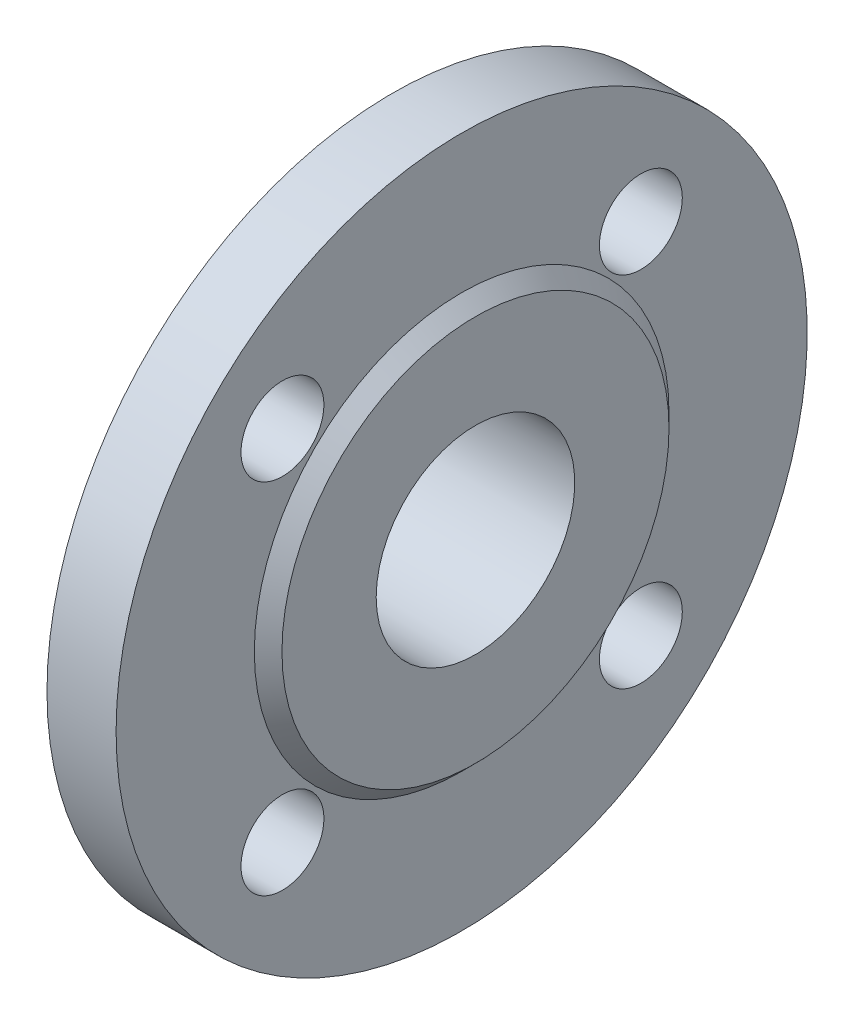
ISO-10303-21;
HEADER;
FILE_DESCRIPTION(('STEP AP214'),'2;1');
FILE_NAME('part.step','',(''),(''),'','','');
FILE_SCHEMA(('AUTOMOTIVE_DESIGN { 1 0 10303 214 1 1 1 1 }'));
ENDSEC;
DATA;
#1=APPLICATION_CONTEXT('core data for automotive mechanical design processes');
#2=APPLICATION_PROTOCOL_DEFINITION('international standard','automotive_design',2000,#1);
#3=PRODUCT_CONTEXT('',#1,'mechanical');
#4=PRODUCT('Part','Part','',(#3));
#5=PRODUCT_RELATED_PRODUCT_CATEGORY('part','',(#4));
#6=PRODUCT_DEFINITION_FORMATION('','',#4);
#7=PRODUCT_DEFINITION_CONTEXT('part definition',#1,'design');
#8=PRODUCT_DEFINITION('design','',#6,#7);
#9=PRODUCT_DEFINITION_SHAPE('','',#8);
#10=(LENGTH_UNIT() NAMED_UNIT(*) SI_UNIT(.MILLI.,.METRE.));
#11=(NAMED_UNIT(*) PLANE_ANGLE_UNIT() SI_UNIT($,.RADIAN.));
#12=(NAMED_UNIT(*) SI_UNIT($,.STERADIAN.) SOLID_ANGLE_UNIT());
#13=UNCERTAINTY_MEASURE_WITH_UNIT(LENGTH_MEASURE(1.E-05),#10,'distance_accuracy_value','');
#14=(GEOMETRIC_REPRESENTATION_CONTEXT(3) GLOBAL_UNCERTAINTY_ASSIGNED_CONTEXT((#13)) GLOBAL_UNIT_ASSIGNED_CONTEXT((#10,
#11,#12)) REPRESENTATION_CONTEXT('',''));
#15=CARTESIAN_POINT('',(0.,0.,0.));
#16=DIRECTION('',(0.,0.,1.));
#17=DIRECTION('',(1.,0.,0.));
#18=AXIS2_PLACEMENT_3D('',#15,#16,#17);
#19=CARTESIAN_POINT('',(678.,-385.45,0.));
#20=DIRECTION('',(1.,0.,0.));
#21=DIRECTION('',(0.,0.,-1.));
#22=AXIS2_PLACEMENT_3D('',#19,#20,#21);
#23=PLANE('',#22);
#24=CARTESIAN_POINT('',(678.,-407.,0.));
#25=DIRECTION('',(-1.,0.,0.));
#26=DIRECTION('',(0.,0.,1.));
#27=AXIS2_PLACEMENT_3D('',#24,#25,#26);
#28=CIRCLE('',#27,21.55);
#29=CARTESIAN_POINT('',(678.,-407.,21.55));
#30=VERTEX_POINT('',#29);
#31=EDGE_CURVE('E60',#30,#30,#28,.T.);
#32=ORIENTED_EDGE('',*,*,#31,.F.);
#33=EDGE_LOOP('',(#32));
#34=FACE_BOUND('',#33,.T.);
#35=CARTESIAN_POINT('',(678.,-407.,0.));
#36=DIRECTION('',(-1.,0.,0.));
#37=DIRECTION('',(0.,0.,1.));
#38=AXIS2_PLACEMENT_3D('',#35,#36,#37);
#39=CIRCLE('',#38,24.15);
#40=CARTESIAN_POINT('',(678.,-407.,24.15));
#41=VERTEX_POINT('',#40);
#42=EDGE_CURVE('E10',#41,#41,#39,.T.);
#43=ORIENTED_EDGE('',*,*,#42,.T.);
#44=EDGE_LOOP('',(#43));
#45=FACE_BOUND('',#44,.T.);
#46=ADVANCED_FACE('F29',(#34,#45),#23,.F.);
#47=CARTESIAN_POINT('',(678.,-407.,0.));
#48=DIRECTION('',(-1.,0.,0.));
#49=DIRECTION('',(0.,0.,1.));
#50=AXIS2_PLACEMENT_3D('',#47,#48,#49);
#51=CYLINDRICAL_SURFACE('',#50,24.15);
#52=ORIENTED_EDGE('',*,*,#42,.F.);
#53=EDGE_LOOP('',(#52));
#54=FACE_BOUND('',#53,.T.);
#55=CARTESIAN_POINT('',(685.,-407.,0.));
#56=DIRECTION('',(-1.,0.,0.));
#57=DIRECTION('',(0.,0.,1.));
#58=AXIS2_PLACEMENT_3D('',#55,#56,#57);
#59=CIRCLE('',#58,24.15);
#60=CARTESIAN_POINT('',(685.,-407.,24.15));
#61=VERTEX_POINT('',#60);
#62=EDGE_CURVE('E35',#61,#61,#59,.T.);
#63=ORIENTED_EDGE('',*,*,#62,.T.);
#64=EDGE_LOOP('',(#63));
#65=FACE_BOUND('',#64,.T.);
#66=ADVANCED_FACE('F126',(#54,#65),#51,.T.);
#67=CARTESIAN_POINT('',(702.,-407.,0.));
#68=DIRECTION('',(1.,0.,0.));
#69=DIRECTION('',(0.,0.,-1.));
#70=AXIS2_PLACEMENT_3D('',#67,#68,#69);
#71=CONICAL_SURFACE('',#70,32.,0.43259427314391);
#72=ORIENTED_EDGE('',*,*,#62,.F.);
#73=EDGE_LOOP('',(#72));
#74=FACE_BOUND('',#73,.T.);
#75=CARTESIAN_POINT('',(702.,-407.,0.));
#76=DIRECTION('',(-1.,0.,0.));
#77=DIRECTION('',(0.,0.,1.));
#78=AXIS2_PLACEMENT_3D('',#75,#76,#77);
#79=CIRCLE('',#78,32.);
#80=CARTESIAN_POINT('',(702.,-407.,32.));
#81=VERTEX_POINT('',#80);
#82=EDGE_CURVE('E39',#81,#81,#79,.T.);
#83=ORIENTED_EDGE('',*,*,#82,.T.);
#84=EDGE_LOOP('',(#83));
#85=FACE_BOUND('',#84,.T.);
#86=ADVANCED_FACE('F130',(#74,#85),#71,.T.);
#87=CARTESIAN_POINT('',(702.,-375.,0.));
#88=DIRECTION('',(1.,0.,0.));
#89=DIRECTION('',(0.,0.,-1.));
#90=AXIS2_PLACEMENT_3D('',#87,#88,#89);
#91=PLANE('',#90);
#92=CARTESIAN_POINT('',(702.,-368.10912703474,38.8908729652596));
#93=DIRECTION('',(1.,0.,0.));
#94=DIRECTION('',(0.,0.,-1.));
#95=AXIS2_PLACEMENT_3D('',#92,#93,#94);
#96=CIRCLE('',#95,9.00000000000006);
#97=CARTESIAN_POINT('',(702.,-368.10912703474,29.8908729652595));
#98=VERTEX_POINT('',#97);
#99=EDGE_CURVE('E81',#98,#98,#96,.T.);
#100=ORIENTED_EDGE('',*,*,#99,.T.);
#101=EDGE_LOOP('',(#100));
#102=FACE_BOUND('',#101,.T.);
#103=CARTESIAN_POINT('',(702.,-445.89087296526,38.8908729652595));
#104=DIRECTION('',(1.,0.,0.));
#105=DIRECTION('',(0.,0.,-1.));
#106=AXIS2_PLACEMENT_3D('',#103,#104,#105);
#107=CIRCLE('',#106,9.00000000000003);
#108=CARTESIAN_POINT('',(702.,-445.89087296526,29.8908729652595));
#109=VERTEX_POINT('',#108);
#110=EDGE_CURVE('E75',#109,#109,#107,.T.);
#111=ORIENTED_EDGE('',*,*,#110,.T.);
#112=EDGE_LOOP('',(#111));
#113=FACE_BOUND('',#112,.T.);
#114=CARTESIAN_POINT('',(702.,-445.89087296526,-38.8908729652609));
#115=DIRECTION('',(1.,0.,0.));
#116=DIRECTION('',(0.,0.,-1.));
#117=AXIS2_PLACEMENT_3D('',#114,#115,#116);
#118=CIRCLE('',#117,9.00000000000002);
#119=CARTESIAN_POINT('',(702.,-445.89087296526,-47.8908729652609));
#120=VERTEX_POINT('',#119);
#121=EDGE_CURVE('E69',#120,#120,#118,.T.);
#122=ORIENTED_EDGE('',*,*,#121,.T.);
#123=EDGE_LOOP('',(#122));
#124=FACE_BOUND('',#123,.T.);
#125=CARTESIAN_POINT('',(702.,-368.10912703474,-38.8908729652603));
#126=DIRECTION('',(1.,0.,0.));
#127=DIRECTION('',(0.,0.,-1.));
#128=AXIS2_PLACEMENT_3D('',#125,#126,#127);
#129=CIRCLE('',#128,9.00000000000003);
#130=CARTESIAN_POINT('',(702.,-368.10912703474,-47.8908729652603));
#131=VERTEX_POINT('',#130);
#132=EDGE_CURVE('E63',#131,#131,#129,.T.);
#133=ORIENTED_EDGE('',*,*,#132,.T.);
#134=EDGE_LOOP('',(#133));
#135=FACE_BOUND('',#134,.T.);
#136=ORIENTED_EDGE('',*,*,#82,.F.);
#137=EDGE_LOOP('',(#136));
#138=FACE_BOUND('',#137,.T.);
#139=CARTESIAN_POINT('',(702.,-407.,0.));
#140=DIRECTION('',(-1.,0.,0.));
#141=DIRECTION('',(0.,0.,1.));
#142=AXIS2_PLACEMENT_3D('',#139,#140,#141);
#143=CIRCLE('',#142,75.);
#144=CARTESIAN_POINT('',(702.,-407.,75.));
#145=VERTEX_POINT('',#144);
#146=EDGE_CURVE('E43',#145,#145,#143,.T.);
#147=ORIENTED_EDGE('',*,*,#146,.T.);
#148=EDGE_LOOP('',(#147));
#149=FACE_BOUND('',#148,.T.);
#150=ADVANCED_FACE('F135',(#102,#113,#124,#135,#138,#149),#91,.F.);
#151=CARTESIAN_POINT('',(678.,-407.,0.));
#152=DIRECTION('',(-1.,0.,0.));
#153=DIRECTION('',(0.,0.,1.));
#154=AXIS2_PLACEMENT_3D('',#151,#152,#153);
#155=CYLINDRICAL_SURFACE('',#154,75.);
#156=ORIENTED_EDGE('',*,*,#146,.F.);
#157=EDGE_LOOP('',(#156));
#158=FACE_BOUND('',#157,.T.);
#159=CARTESIAN_POINT('',(717.,-407.,0.));
#160=DIRECTION('',(-1.,0.,0.));
#161=DIRECTION('',(0.,0.,1.));
#162=AXIS2_PLACEMENT_3D('',#159,#160,#161);
#163=CIRCLE('',#162,75.);
#164=CARTESIAN_POINT('',(717.,-407.,75.));
#165=VERTEX_POINT('',#164);
#166=EDGE_CURVE('E48',#165,#165,#163,.T.);
#167=ORIENTED_EDGE('',*,*,#166,.T.);
#168=EDGE_LOOP('',(#167));
#169=FACE_BOUND('',#168,.T.);
#170=ADVANCED_FACE('F95',(#158,#169),#155,.T.);
#171=CARTESIAN_POINT('',(717.,-332.,0.));
#172=DIRECTION('',(-1.,0.,0.));
#173=DIRECTION('',(0.,0.,1.));
#174=AXIS2_PLACEMENT_3D('',#171,#172,#173);
#175=PLANE('',#174);
#176=CARTESIAN_POINT('',(717.,-368.10912703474,38.8908729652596));
#177=DIRECTION('',(1.,0.,0.));
#178=DIRECTION('',(0.,0.,-1.));
#179=AXIS2_PLACEMENT_3D('',#176,#177,#178);
#180=CIRCLE('',#179,9.00000000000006);
#181=CARTESIAN_POINT('',(717.,-368.10912703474,29.8908729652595));
#182=VERTEX_POINT('',#181);
#183=EDGE_CURVE('E84',#182,#182,#180,.T.);
#184=ORIENTED_EDGE('',*,*,#183,.F.);
#185=EDGE_LOOP('',(#184));
#186=FACE_BOUND('',#185,.T.);
#187=CARTESIAN_POINT('',(717.,-445.89087296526,38.8908729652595));
#188=DIRECTION('',(1.,0.,0.));
#189=DIRECTION('',(0.,0.,-1.));
#190=AXIS2_PLACEMENT_3D('',#187,#188,#189);
#191=CIRCLE('',#190,9.00000000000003);
#192=CARTESIAN_POINT('',(717.,-445.89087296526,29.8908729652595));
#193=VERTEX_POINT('',#192);
#194=EDGE_CURVE('E78',#193,#193,#191,.T.);
#195=ORIENTED_EDGE('',*,*,#194,.F.);
#196=EDGE_LOOP('',(#195));
#197=FACE_BOUND('',#196,.T.);
#198=CARTESIAN_POINT('',(717.,-445.89087296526,-38.8908729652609));
#199=DIRECTION('',(1.,0.,0.));
#200=DIRECTION('',(0.,0.,-1.));
#201=AXIS2_PLACEMENT_3D('',#198,#199,#200);
#202=CIRCLE('',#201,9.00000000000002);
#203=CARTESIAN_POINT('',(717.,-445.89087296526,-47.8908729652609));
#204=VERTEX_POINT('',#203);
#205=EDGE_CURVE('E72',#204,#204,#202,.T.);
#206=ORIENTED_EDGE('',*,*,#205,.F.);
#207=EDGE_LOOP('',(#206));
#208=FACE_BOUND('',#207,.T.);
#209=CARTESIAN_POINT('',(717.,-368.10912703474,-38.8908729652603));
#210=DIRECTION('',(1.,0.,0.));
#211=DIRECTION('',(0.,0.,-1.));
#212=AXIS2_PLACEMENT_3D('',#209,#210,#211);
#213=CIRCLE('',#212,9.00000000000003);
#214=CARTESIAN_POINT('',(717.,-368.10912703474,-47.8908729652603));
#215=VERTEX_POINT('',#214);
#216=EDGE_CURVE('E66',#215,#215,#213,.T.);
#217=ORIENTED_EDGE('',*,*,#216,.F.);
#218=EDGE_LOOP('',(#217));
#219=FACE_BOUND('',#218,.T.);
#220=ORIENTED_EDGE('',*,*,#166,.F.);
#221=EDGE_LOOP('',(#220));
#222=FACE_BOUND('',#221,.T.);
#223=CARTESIAN_POINT('',(717.,-407.,0.));
#224=DIRECTION('',(-1.,0.,0.));
#225=DIRECTION('',(0.,0.,1.));
#226=AXIS2_PLACEMENT_3D('',#223,#224,#225);
#227=CIRCLE('',#226,45.);
#228=CARTESIAN_POINT('',(717.,-407.,45.));
#229=VERTEX_POINT('',#228);
#230=EDGE_CURVE('E51',#229,#229,#227,.T.);
#231=ORIENTED_EDGE('',*,*,#230,.T.);
#232=EDGE_LOOP('',(#231));
#233=FACE_BOUND('',#232,.T.);
#234=ADVANCED_FACE('F91',(#186,#197,#208,#219,#222,#233),#175,.F.);
#235=CARTESIAN_POINT('',(720.,-407.,0.));
#236=DIRECTION('',(-1.,0.,0.));
#237=DIRECTION('',(0.,0.,1.));
#238=AXIS2_PLACEMENT_3D('',#235,#236,#237);
#239=CONICAL_SURFACE('',#238,42.,0.785398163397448);
#240=ORIENTED_EDGE('',*,*,#230,.F.);
#241=EDGE_LOOP('',(#240));
#242=FACE_BOUND('',#241,.T.);
#243=CARTESIAN_POINT('',(720.,-407.,0.));
#244=DIRECTION('',(-1.,0.,0.));
#245=DIRECTION('',(0.,0.,1.));
#246=AXIS2_PLACEMENT_3D('',#243,#244,#245);
#247=CIRCLE('',#246,42.);
#248=CARTESIAN_POINT('',(720.,-407.,42.));
#249=VERTEX_POINT('',#248);
#250=EDGE_CURVE('E54',#249,#249,#247,.T.);
#251=ORIENTED_EDGE('',*,*,#250,.T.);
#252=EDGE_LOOP('',(#251));
#253=FACE_BOUND('',#252,.T.);
#254=ADVANCED_FACE('F94',(#242,#253),#239,.T.);
#255=CARTESIAN_POINT('',(720.,-365.,0.));
#256=DIRECTION('',(-1.,0.,0.));
#257=DIRECTION('',(0.,0.,1.));
#258=AXIS2_PLACEMENT_3D('',#255,#256,#257);
#259=PLANE('',#258);
#260=ORIENTED_EDGE('',*,*,#250,.F.);
#261=EDGE_LOOP('',(#260));
#262=FACE_BOUND('',#261,.T.);
#263=CARTESIAN_POINT('',(720.,-407.,0.));
#264=DIRECTION('',(-1.,0.,0.));
#265=DIRECTION('',(0.,0.,1.));
#266=AXIS2_PLACEMENT_3D('',#263,#264,#265);
#267=CIRCLE('',#266,21.55);
#268=CARTESIAN_POINT('',(720.,-407.,21.55));
#269=VERTEX_POINT('',#268);
#270=EDGE_CURVE('E57',#269,#269,#267,.T.);
#271=ORIENTED_EDGE('',*,*,#270,.T.);
#272=EDGE_LOOP('',(#271));
#273=FACE_BOUND('',#272,.T.);
#274=ADVANCED_FACE('F109',(#262,#273),#259,.F.);
#275=CARTESIAN_POINT('',(678.,-407.,0.));
#276=DIRECTION('',(-1.,0.,0.));
#277=DIRECTION('',(0.,0.,1.));
#278=AXIS2_PLACEMENT_3D('',#275,#276,#277);
#279=CYLINDRICAL_SURFACE('',#278,21.55);
#280=ORIENTED_EDGE('',*,*,#270,.F.);
#281=EDGE_LOOP('',(#280));
#282=FACE_BOUND('',#281,.T.);
#283=ORIENTED_EDGE('',*,*,#31,.T.);
#284=EDGE_LOOP('',(#283));
#285=FACE_BOUND('',#284,.T.);
#286=ADVANCED_FACE('F115',(#282,#285),#279,.F.);
#287=CARTESIAN_POINT('',(678.,-368.10912703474,-38.8908729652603));
#288=DIRECTION('',(1.,0.,0.));
#289=DIRECTION('',(0.,0.,-1.));
#290=AXIS2_PLACEMENT_3D('',#287,#288,#289);
#291=CYLINDRICAL_SURFACE('',#290,9.00000000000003);
#292=ORIENTED_EDGE('',*,*,#216,.T.);
#293=EDGE_LOOP('',(#292));
#294=FACE_BOUND('',#293,.T.);
#295=ORIENTED_EDGE('',*,*,#132,.F.);
#296=EDGE_LOOP('',(#295));
#297=FACE_BOUND('',#296,.T.);
#298=ADVANCED_FACE('F121',(#294,#297),#291,.F.);
#299=CARTESIAN_POINT('',(678.,-445.89087296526,-38.8908729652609));
#300=DIRECTION('',(1.,0.,0.));
#301=DIRECTION('',(0.,0.,-1.));
#302=AXIS2_PLACEMENT_3D('',#299,#300,#301);
#303=CYLINDRICAL_SURFACE('',#302,9.00000000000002);
#304=ORIENTED_EDGE('',*,*,#205,.T.);
#305=EDGE_LOOP('',(#304));
#306=FACE_BOUND('',#305,.T.);
#307=ORIENTED_EDGE('',*,*,#121,.F.);
#308=EDGE_LOOP('',(#307));
#309=FACE_BOUND('',#308,.T.);
#310=ADVANCED_FACE('F147',(#306,#309),#303,.F.);
#311=CARTESIAN_POINT('',(678.,-445.89087296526,38.8908729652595));
#312=DIRECTION('',(1.,0.,0.));
#313=DIRECTION('',(0.,0.,-1.));
#314=AXIS2_PLACEMENT_3D('',#311,#312,#313);
#315=CYLINDRICAL_SURFACE('',#314,9.00000000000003);
#316=ORIENTED_EDGE('',*,*,#194,.T.);
#317=EDGE_LOOP('',(#316));
#318=FACE_BOUND('',#317,.T.);
#319=ORIENTED_EDGE('',*,*,#110,.F.);
#320=EDGE_LOOP('',(#319));
#321=FACE_BOUND('',#320,.T.);
#322=ADVANCED_FACE('F151',(#318,#321),#315,.F.);
#323=CARTESIAN_POINT('',(678.,-368.10912703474,38.8908729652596));
#324=DIRECTION('',(1.,0.,0.));
#325=DIRECTION('',(0.,0.,-1.));
#326=AXIS2_PLACEMENT_3D('',#323,#324,#325);
#327=CYLINDRICAL_SURFACE('',#326,9.00000000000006);
#328=ORIENTED_EDGE('',*,*,#183,.T.);
#329=EDGE_LOOP('',(#328));
#330=FACE_BOUND('',#329,.T.);
#331=ORIENTED_EDGE('',*,*,#99,.F.);
#332=EDGE_LOOP('',(#331));
#333=FACE_BOUND('',#332,.T.);
#334=ADVANCED_FACE('F88',(#330,#333),#327,.F.);
#335=CLOSED_SHELL('',(#46,#66,#86,#150,#170,#234,#254,#274,#286,#298,#310,#322,#334));
#336=MANIFOLD_SOLID_BREP('B2',#335);
#337=ADVANCED_BREP_SHAPE_REPRESENTATION('',(#18,#336),#14);
#338=SHAPE_DEFINITION_REPRESENTATION(#9,#337);
ENDSEC;
END-ISO-10303-21;
